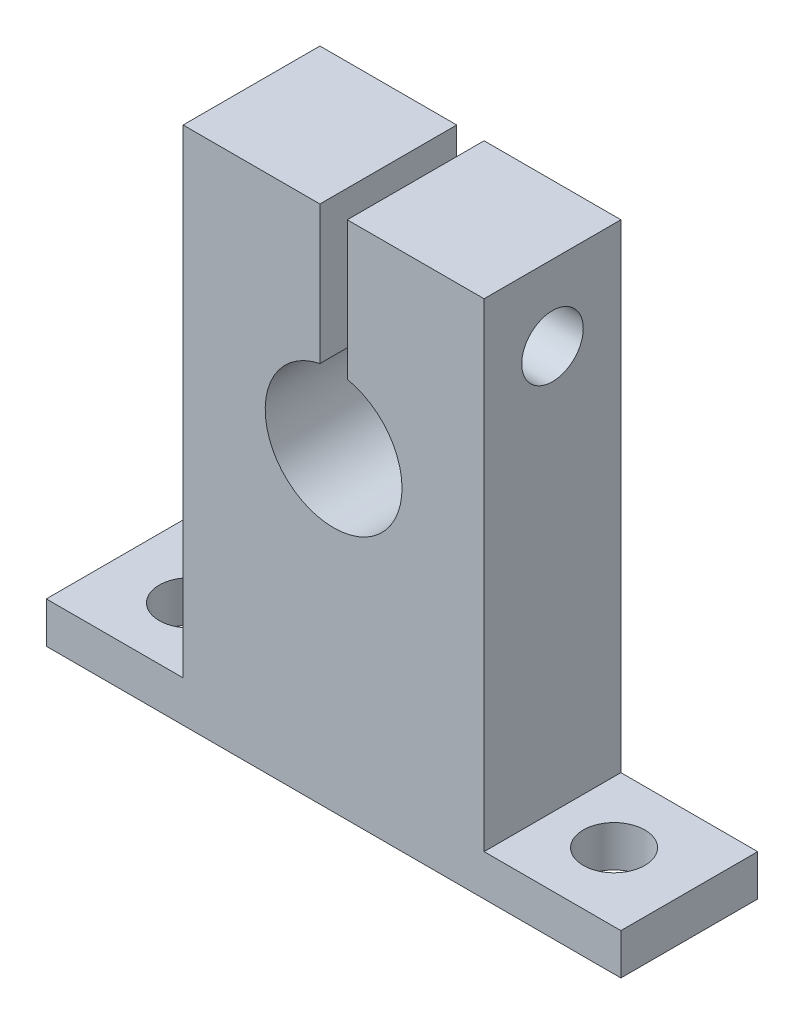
from build123d import *

# Parameters (mm, degrees)
SKETCH2_R           = 5
BOSS_EXTRUDE1_DEPTH = 10
SKETCH4_R           = 2.25
CUT_EXTRUDE2_DEPTH  = 10
SKETCH5_R           = 2.25
CUT_EXTRUDE3_DEPTH  = 30
CUT_EXTRUDE4_DEPTH  = 15


with BuildPart() as part:
    # Sketch2 → Boss-Extrude1 (new body)
    with BuildSketch(Plane.XY):
        Polygon((-11, 3), (-11, 15), (11, 15), (11, 3), (11, -20), (21, -20), (21, -23), (-21, -23), (-21, -20), (-11, -20), align=None)
        Circle(SKETCH2_R, mode=Mode.SUBTRACT)
    extrude(amount=BOSS_EXTRUDE1_DEPTH)

    # Sketch4 → Cut-Extrude2 (cut)
    with BuildSketch(Plane(origin=(0, -20, 0), x_dir=(1, 0, 0), z_dir=(0, 1, 0))):
        with Locations(Location((-15.5, -5, 0), (0, 0, 270))):
            Circle(SKETCH4_R)
        with Locations(Location((15.5, -5, 0), (0, 0, 270))):
            Circle(SKETCH4_R)
    extrude(amount=-CUT_EXTRUDE2_DEPTH, mode=Mode.SUBTRACT)

    # Sketch5 → Cut-Extrude3 (cut)
    with BuildSketch(Plane(origin=(11, 0, 0), x_dir=(0, 0, -1), z_dir=(1, 0, 0))):
        with Locations((-5, 9.5)):
            Circle(SKETCH5_R)
    extrude(amount=-CUT_EXTRUDE3_DEPTH, mode=Mode.SUBTRACT)

    # Sketch6 → Cut-Extrude4 (cut)
    with BuildSketch(Plane(origin=(0, 15, 0), x_dir=(1, 0, 0), z_dir=(0, 1, 0))):
        Polygon((0, 0), (1, 0), (1, -10), (-1, -10), (-1, 0), align=None)
    extrude(amount=-CUT_EXTRUDE4_DEPTH, mode=Mode.SUBTRACT)


solid = part.part
